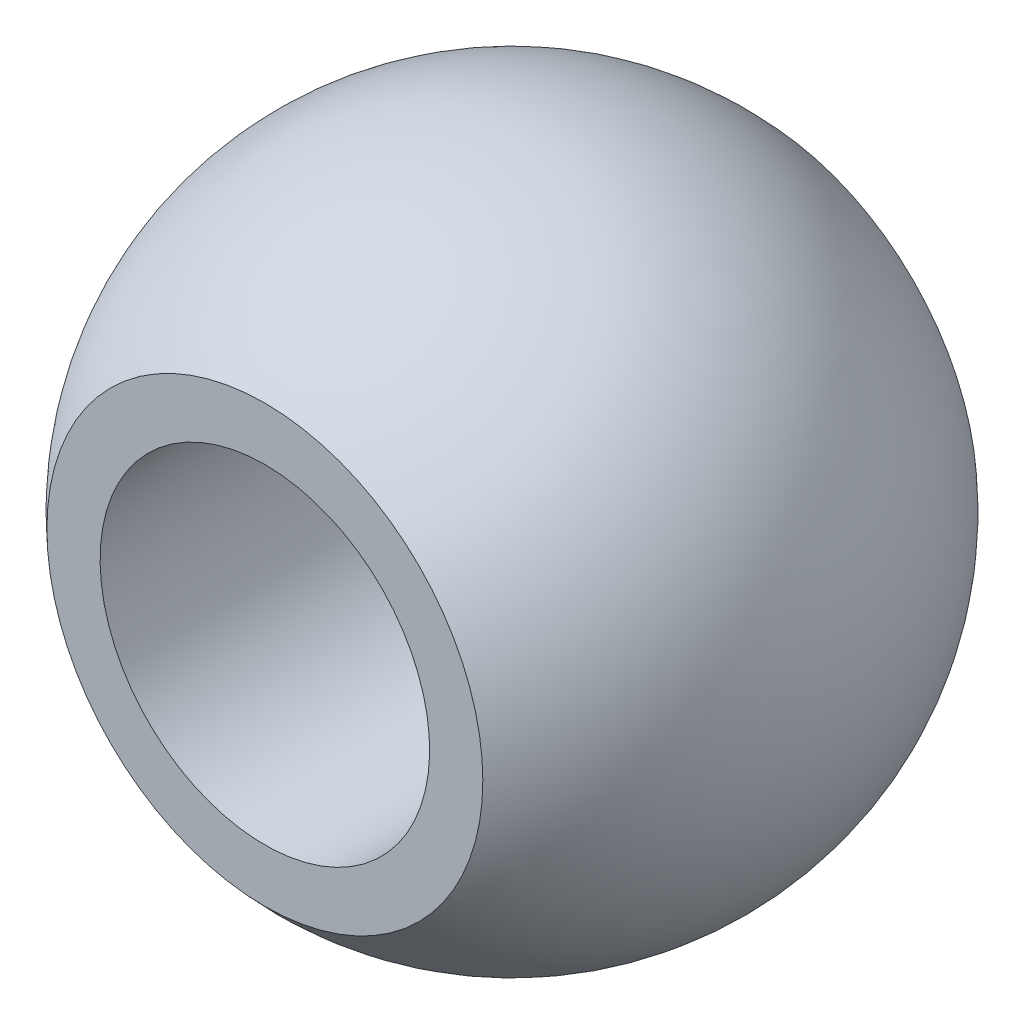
ISO-10303-21;
HEADER;
FILE_DESCRIPTION(('STEP AP214'),'2;1');
FILE_NAME('part.step','',(''),(''),'','','');
FILE_SCHEMA(('AUTOMOTIVE_DESIGN { 1 0 10303 214 1 1 1 1 }'));
ENDSEC;
DATA;
#1=APPLICATION_CONTEXT('core data for automotive mechanical design processes');
#2=APPLICATION_PROTOCOL_DEFINITION('international standard','automotive_design',2000,#1);
#3=PRODUCT_CONTEXT('',#1,'mechanical');
#4=PRODUCT('Part','Part','',(#3));
#5=PRODUCT_RELATED_PRODUCT_CATEGORY('part','',(#4));
#6=PRODUCT_DEFINITION_FORMATION('','',#4);
#7=PRODUCT_DEFINITION_CONTEXT('part definition',#1,'design');
#8=PRODUCT_DEFINITION('design','',#6,#7);
#9=PRODUCT_DEFINITION_SHAPE('','',#8);
#10=(LENGTH_UNIT() NAMED_UNIT(*) SI_UNIT(.MILLI.,.METRE.));
#11=(NAMED_UNIT(*) PLANE_ANGLE_UNIT() SI_UNIT($,.RADIAN.));
#12=(NAMED_UNIT(*) SI_UNIT($,.STERADIAN.) SOLID_ANGLE_UNIT());
#13=UNCERTAINTY_MEASURE_WITH_UNIT(LENGTH_MEASURE(1.E-05),#10,'distance_accuracy_value','');
#14=(GEOMETRIC_REPRESENTATION_CONTEXT(3) GLOBAL_UNCERTAINTY_ASSIGNED_CONTEXT((#13)) GLOBAL_UNIT_ASSIGNED_CONTEXT((#10,
#11,#12)) REPRESENTATION_CONTEXT('',''));
#15=CARTESIAN_POINT('',(0.,0.,0.));
#16=DIRECTION('',(0.,0.,1.));
#17=DIRECTION('',(1.,0.,0.));
#18=AXIS2_PLACEMENT_3D('',#15,#16,#17);
#19=CARTESIAN_POINT('',(8.88178419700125E-13,-4.16333634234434E-13,-1.38777878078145E-13));
#20=DIRECTION('',(0.,0.,1.00000000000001));
#21=DIRECTION('',(1.00000000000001,0.,0.));
#22=AXIS2_PLACEMENT_3D('',#19,#20,#21);
#23=SPHERICAL_SURFACE('',#22,6.35);
#24=CARTESIAN_POINT('',(-7.7715611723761E-13,-1.12410081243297E-12,-4.76250000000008));
#25=DIRECTION('',(0.,0.,1.00000000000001));
#26=DIRECTION('',(0.,-1.00000000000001,0.));
#27=AXIS2_PLACEMENT_3D('',#24,#25,#26);
#28=CIRCLE('',#27,4.20013020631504);
#29=CARTESIAN_POINT('',(4.2001302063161,-3.64749477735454E-13,-4.76250000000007));
#30=VERTEX_POINT('',#29);
#31=EDGE_CURVE('E42',#30,#30,#28,.T.);
#32=CARTESIAN_POINT('',(-5.55111512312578E-13,-1.37390099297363E-12,4.76249999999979));
#33=DIRECTION('',(0.,0.,-1.00000000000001));
#34=DIRECTION('',(0.,1.00000000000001,0.));
#35=AXIS2_PLACEMENT_3D('',#32,#33,#34);
#36=CIRCLE('',#35,4.20013020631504);
#37=CARTESIAN_POINT('',(4.2001302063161,-4.36675146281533E-13,4.76249999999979));
#38=VERTEX_POINT('',#37);
#39=EDGE_CURVE('E10',#38,#38,#36,.T.);
#40=CARTESIAN_POINT('',(4.2001302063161,-3.64749477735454E-13,-4.76250000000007));
#41=CARTESIAN_POINT('',(4.28427596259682,-3.64996863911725E-13,-4.68829441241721));
#42=CARTESIAN_POINT('',(4.36645097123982,-3.65268450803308E-13,-4.61185462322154));
#43=CARTESIAN_POINT('',(4.52663790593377,-3.65859157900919E-13,-4.45473074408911));
#44=CARTESIAN_POINT('',(4.60464983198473,-3.66178278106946E-13,-4.37404665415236));
#45=CARTESIAN_POINT('',(4.75628901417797,-3.66863183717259E-13,-4.20865827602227));
#46=CARTESIAN_POINT('',(4.82991627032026,-3.67228969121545E-13,-4.12395398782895));
#47=CARTESIAN_POINT('',(4.97257997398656,-3.68006170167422E-13,-3.95076380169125));
#48=CARTESIAN_POINT('',(5.04161642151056,-3.68417585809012E-13,-3.86227790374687));
#49=CARTESIAN_POINT('',(5.17490442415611,-3.69284893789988E-13,-3.68177285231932));
#50=CARTESIAN_POINT('',(5.23915597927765,-3.69740786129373E-13,-3.58975369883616));
#51=CARTESIAN_POINT('',(5.36269377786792,-3.70695766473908E-13,-3.40244064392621));
#52=CARTESIAN_POINT('',(5.42198002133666,-3.71194854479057E-13,-3.30714674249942));
#53=CARTESIAN_POINT('',(5.5354206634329,-3.72234824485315E-13,-3.1135518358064));
#54=CARTESIAN_POINT('',(5.5895750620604,-3.72775706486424E-13,-3.01525083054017));
#55=CARTESIAN_POINT('',(5.69259991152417,-3.73897745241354E-13,-2.81591782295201));
#56=CARTESIAN_POINT('',(5.74147036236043,-3.74478901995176E-13,-2.71488582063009));
#57=CARTESIAN_POINT('',(5.83379005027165,-3.7567985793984E-13,-2.51037459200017));
#58=CARTESIAN_POINT('',(5.8772392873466,-3.76299657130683E-13,-2.40689536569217));
#59=CARTESIAN_POINT('',(5.95859450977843,-3.77576157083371E-13,-2.19778033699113));
#60=CARTESIAN_POINT('',(5.99650049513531,-3.78232857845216E-13,-2.09214453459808));
#61=CARTESIAN_POINT('',(6.06666274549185,-3.7958131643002E-13,-1.87901305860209));
#62=CARTESIAN_POINT('',(6.09891901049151,-3.80273074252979E-13,-1.77151738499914));
#63=CARTESIAN_POINT('',(6.1576912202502,-3.8168970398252E-13,-1.55496809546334));
#64=CARTESIAN_POINT('',(6.18420716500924,-3.82414575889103E-13,-1.44591447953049));
#65=CARTESIAN_POINT('',(6.23142425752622,-3.83895397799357E-13,-1.22655561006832));
#66=CARTESIAN_POINT('',(6.25212540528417,-3.84651347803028E-13,-1.11625035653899));
#67=CARTESIAN_POINT('',(6.28765475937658,-3.86192202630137E-13,-0.894698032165));
#68=CARTESIAN_POINT('',(6.30248296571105,-3.86977107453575E-13,-0.783450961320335));
#69=CARTESIAN_POINT('',(6.32622478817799,-3.8857366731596E-13,-0.560327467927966));
#70=CARTESIAN_POINT('',(6.33513840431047,-3.89385322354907E-13,-0.448451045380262));
#71=CARTESIAN_POINT('',(6.34702601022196,-3.91033102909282E-13,-0.224383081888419));
#72=CARTESIAN_POINT('',(6.35000000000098,-3.9186922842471E-13,-0.112191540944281));
#73=CARTESIAN_POINT('',(6.35000000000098,-3.93563601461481E-13,0.112191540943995));
#74=CARTESIAN_POINT('',(6.34702601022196,-3.94421848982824E-13,0.224383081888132));
#75=CARTESIAN_POINT('',(6.33513840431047,-3.96158055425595E-13,0.448451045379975));
#76=CARTESIAN_POINT('',(6.32622478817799,-3.97036014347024E-13,0.56032746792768));
#77=CARTESIAN_POINT('',(6.30248296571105,-3.9880917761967E-13,0.783450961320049));
#78=CARTESIAN_POINT('',(6.28765475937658,-3.99704381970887E-13,0.894698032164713));
#79=CARTESIAN_POINT('',(6.25212540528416,-4.01509521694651E-13,1.1162503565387));
#80=CARTESIAN_POINT('',(6.23142425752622,-4.02419457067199E-13,1.22655561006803));
#81=CARTESIAN_POINT('',(6.18420716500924,-4.0425150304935E-13,1.4459144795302));
#82=CARTESIAN_POINT('',(6.1576912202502,-4.05173613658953E-13,1.55496809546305));
#83=CARTESIAN_POINT('',(6.0989190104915,-4.07027420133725E-13,1.77151738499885));
#84=CARTESIAN_POINT('',(6.06666274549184,-4.07959115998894E-13,1.8790130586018));
#85=CARTESIAN_POINT('',(5.99650049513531,-4.09829476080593E-13,2.0921445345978));
#86=CARTESIAN_POINT('',(5.95859450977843,-4.10768140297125E-13,2.19778033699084));
#87=CARTESIAN_POINT('',(5.8772392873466,-4.12649800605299E-13,2.40689536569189));
#88=CARTESIAN_POINT('',(5.83379005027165,-4.13592796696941E-13,2.51037459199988));
#89=CARTESIAN_POINT('',(5.74147036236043,-4.15480472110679E-13,2.7148858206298));
#90=CARTESIAN_POINT('',(5.69259991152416,-4.16425151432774E-13,2.81591782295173));
#91=CARTESIAN_POINT('',(5.58957506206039,-4.18313539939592E-13,3.01525083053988));
#92=CARTESIAN_POINT('',(5.53542066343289,-4.19257249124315E-13,3.11355183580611));
#93=CARTESIAN_POINT('',(5.42198002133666,-4.21141046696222E-13,3.30714674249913));
#94=CARTESIAN_POINT('',(5.36269377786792,-4.22081135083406E-13,3.40244064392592));
#95=CARTESIAN_POINT('',(5.23915597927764,-4.23955050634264E-13,3.58975369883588));
#96=CARTESIAN_POINT('',(5.1749044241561,-4.24888877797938E-13,3.68177285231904));
#97=CARTESIAN_POINT('',(5.04161642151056,-4.26747647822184E-13,3.86227790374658));
#98=CARTESIAN_POINT('',(4.97257997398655,-4.27672590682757E-13,3.95076380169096));
#99=CARTESIAN_POINT('',(4.82991627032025,-4.29510994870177E-13,4.12395398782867));
#100=CARTESIAN_POINT('',(4.75628901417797,-4.30424456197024E-13,4.20865827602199));
#101=CARTESIAN_POINT('',(4.60464983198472,-4.3223732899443E-13,4.37404665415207));
#102=CARTESIAN_POINT('',(4.52663790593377,-4.33136740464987E-13,4.45473074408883));
#103=CARTESIAN_POINT('',(4.36645097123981,-4.34918997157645E-13,4.61185462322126));
#104=CARTESIAN_POINT('',(4.28427596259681,-4.35801842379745E-13,4.68829441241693));
#105=CARTESIAN_POINT('',(4.2001302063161,-4.36675146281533E-13,4.76249999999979));
#106=B_SPLINE_CURVE_WITH_KNOTS('',3,(#40,#41,#42,#43,#44,#45,#46,#47,#48,#49,#50,#51,#52,#53,
#54,#55,#56,#57,#58,#59,#60,#61,#62,#63,#64,#65,#66,#67,#68,#69,#70,#71,#72,#73,#74,#75,#76,#77,
#78,#79,#80,#81,#82,#83,#84,#85,#86,#87,#88,#89,#90,#91,#92,#93,#94,#95,#96,#97,#98,#99,#100,
#101,#102,#103,#104,#105),.UNSPECIFIED.,.F.,.F.,(4,2,2,2,2,2,2,2,2,2,2,2,2,2,2,2,2,2,2,2,2,2,2,
2,2,2,2,2,2,2,2,2,4),(0.,0.33653523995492,0.673070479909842,1.00960571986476,1.34614095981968,
1.6826761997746,2.01921143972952,2.35574667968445,2.69228191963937,3.02881715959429,
3.36535239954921,3.70188763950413,4.03842287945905,4.37495811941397,4.71149335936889,
5.04802859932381,5.38456383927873,5.72109907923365,6.05763431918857,6.39416955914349,
6.73070479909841,7.06724003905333,7.40377527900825,7.74031051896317,8.07684575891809,
8.41338099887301,8.74991623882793,9.08645147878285,9.42298671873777,9.75952195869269,
10.0960571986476,10.4325924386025,10.7691276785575),.UNSPECIFIED.);
#107=EDGE_CURVE('BSEAM30',#30,#38,#106,.T.);
#108=ORIENTED_EDGE('',*,*,#31,.T.);
#109=ORIENTED_EDGE('',*,*,#39,.T.);
#110=ORIENTED_EDGE('',*,*,#107,.T.);
#111=ORIENTED_EDGE('',*,*,#107,.F.);
#112=EDGE_LOOP('',(#108,#110,#109,#111));
#113=FACE_BOUND('',#112,.T.);
#114=ADVANCED_FACE('F30',(#113),#23,.T.);
#115=CARTESIAN_POINT('',(7.7715611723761E-13,-1.40165656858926E-12,-6.3500000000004));
#116=DIRECTION('',(0.,0.,1.00000000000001));
#117=DIRECTION('',(1.00000000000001,0.,0.));
#118=AXIS2_PLACEMENT_3D('',#115,#116,#117);
#119=CYLINDRICAL_SURFACE('',#118,3.175);
#120=CARTESIAN_POINT('',(-7.7715611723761E-13,-1.12410081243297E-12,-4.76250000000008));
#121=DIRECTION('',(0.,0.,1.00000000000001));
#122=DIRECTION('',(0.,-1.00000000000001,0.));
#123=AXIS2_PLACEMENT_3D('',#120,#121,#122);
#124=CIRCLE('',#123,3.175);
#125=CARTESIAN_POINT('',(-7.8632100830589E-13,-3.17500000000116,-4.76250000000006));
#126=VERTEX_POINT('',#125);
#127=EDGE_CURVE('E33',#126,#126,#124,.F.);
#128=ORIENTED_EDGE('',*,*,#127,.T.);
#129=EDGE_LOOP('',(#128));
#130=FACE_BOUND('',#129,.T.);
#131=CARTESIAN_POINT('',(-5.55111512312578E-13,-1.37390099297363E-12,4.76249999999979));
#132=DIRECTION('',(0.,0.,-1.00000000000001));
#133=DIRECTION('',(0.,1.00000000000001,0.));
#134=AXIS2_PLACEMENT_3D('',#131,#132,#133);
#135=CIRCLE('',#134,3.175);
#136=CARTESIAN_POINT('',(-5.45594125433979E-13,3.17499999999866,4.76249999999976));
#137=VERTEX_POINT('',#136);
#138=EDGE_CURVE('E37',#137,#137,#135,.F.);
#139=ORIENTED_EDGE('',*,*,#138,.T.);
#140=EDGE_LOOP('',(#139));
#141=FACE_BOUND('',#140,.T.);
#142=ADVANCED_FACE('F50',(#130,#141),#119,.F.);
#143=CARTESIAN_POINT('',(-6.34999999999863,15.2066165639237,4.76249999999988));
#144=DIRECTION('',(0.,0.,-1.00000000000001));
#145=DIRECTION('',(0.,1.00000000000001,0.));
#146=AXIS2_PLACEMENT_3D('',#143,#144,#145);
#147=PLANE('',#146);
#148=ORIENTED_EDGE('',*,*,#138,.F.);
#149=EDGE_LOOP('',(#148));
#150=FACE_BOUND('',#149,.T.);
#151=ORIENTED_EDGE('',*,*,#39,.F.);
#152=EDGE_LOOP('',(#151));
#153=FACE_BOUND('',#152,.T.);
#154=ADVANCED_FACE('F56',(#150,#153),#147,.F.);
#155=CARTESIAN_POINT('',(-6.34999999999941,15.2066165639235,-4.76249999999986));
#156=DIRECTION('',(0.,0.,1.00000000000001));
#157=DIRECTION('',(0.,-1.00000000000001,0.));
#158=AXIS2_PLACEMENT_3D('',#155,#156,#157);
#159=PLANE('',#158);
#160=ORIENTED_EDGE('',*,*,#127,.F.);
#161=EDGE_LOOP('',(#160));
#162=FACE_BOUND('',#161,.T.);
#163=ORIENTED_EDGE('',*,*,#31,.F.);
#164=EDGE_LOOP('',(#163));
#165=FACE_BOUND('',#164,.T.);
#166=ADVANCED_FACE('F53',(#162,#165),#159,.F.);
#167=CLOSED_SHELL('',(#114,#142,#154,#166));
#168=MANIFOLD_SOLID_BREP('B2',#167);
#169=ADVANCED_BREP_SHAPE_REPRESENTATION('',(#18,#168),#14);
#170=SHAPE_DEFINITION_REPRESENTATION(#9,#169);
ENDSEC;
END-ISO-10303-21;
